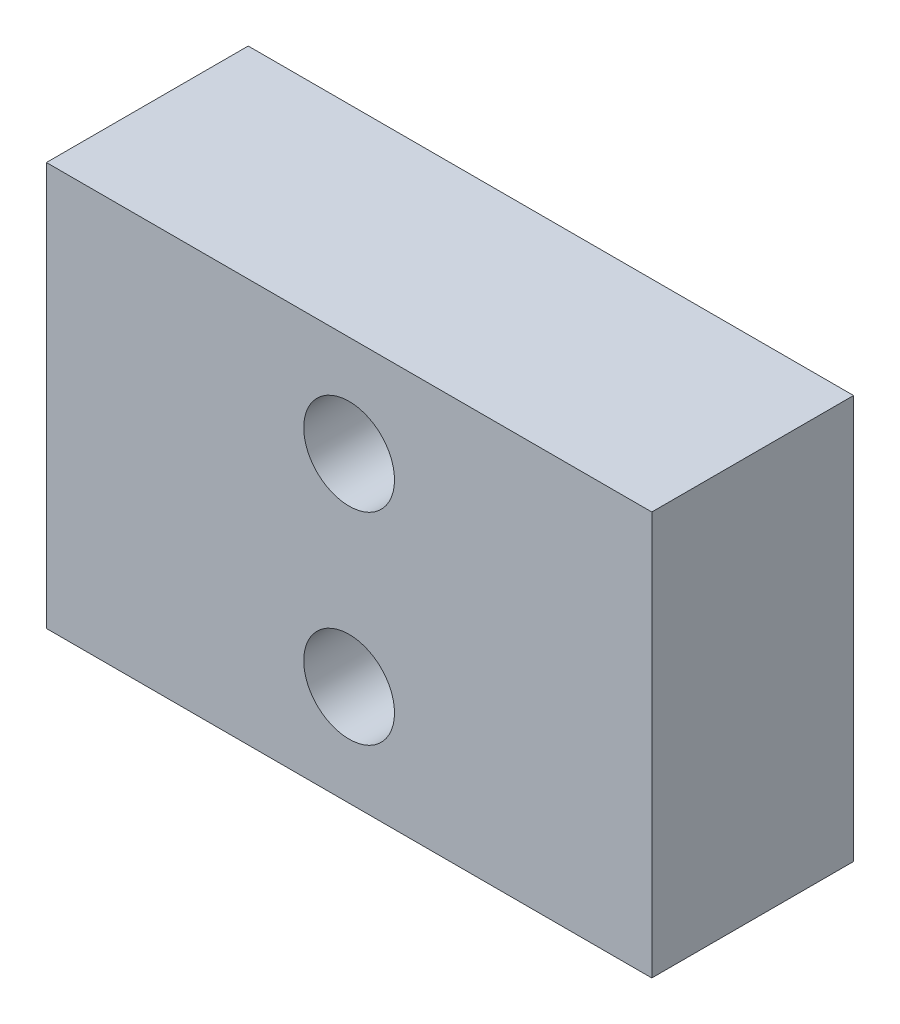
ISO-10303-21;
HEADER;
FILE_DESCRIPTION(('STEP AP214'),'2;1');
FILE_NAME('part.step','',(''),(''),'','','');
FILE_SCHEMA(('AUTOMOTIVE_DESIGN { 1 0 10303 214 1 1 1 1 }'));
ENDSEC;
DATA;
#1=APPLICATION_CONTEXT('core data for automotive mechanical design processes');
#2=APPLICATION_PROTOCOL_DEFINITION('international standard','automotive_design',2000,#1);
#3=PRODUCT_CONTEXT('',#1,'mechanical');
#4=PRODUCT('Part','Part','',(#3));
#5=PRODUCT_RELATED_PRODUCT_CATEGORY('part','',(#4));
#6=PRODUCT_DEFINITION_FORMATION('','',#4);
#7=PRODUCT_DEFINITION_CONTEXT('part definition',#1,'design');
#8=PRODUCT_DEFINITION('design','',#6,#7);
#9=PRODUCT_DEFINITION_SHAPE('','',#8);
#10=(LENGTH_UNIT() NAMED_UNIT(*) SI_UNIT(.MILLI.,.METRE.));
#11=(NAMED_UNIT(*) PLANE_ANGLE_UNIT() SI_UNIT($,.RADIAN.));
#12=(NAMED_UNIT(*) SI_UNIT($,.STERADIAN.) SOLID_ANGLE_UNIT());
#13=UNCERTAINTY_MEASURE_WITH_UNIT(LENGTH_MEASURE(1.E-05),#10,'distance_accuracy_value','');
#14=(GEOMETRIC_REPRESENTATION_CONTEXT(3) GLOBAL_UNCERTAINTY_ASSIGNED_CONTEXT((#13)) GLOBAL_UNIT_ASSIGNED_CONTEXT((#10,
#11,#12)) REPRESENTATION_CONTEXT('',''));
#15=CARTESIAN_POINT('',(0.,0.,0.));
#16=DIRECTION('',(0.,0.,1.));
#17=DIRECTION('',(1.,0.,0.));
#18=AXIS2_PLACEMENT_3D('',#15,#16,#17);
#19=CARTESIAN_POINT('',(-15.,10.,10.));
#20=DIRECTION('',(1.,0.,0.));
#21=DIRECTION('',(0.,1.,0.));
#22=AXIS2_PLACEMENT_3D('',#19,#20,#21);
#23=PLANE('',#22);
#24=DIRECTION('',(0.,-1.,0.));
#25=VECTOR('',#24,1.);
#26=CARTESIAN_POINT('',(-15.,10.,0.));
#27=LINE('',#26,#25);
#28=CARTESIAN_POINT('',(-15.,10.,0.));
#29=VERTEX_POINT('',#28);
#30=CARTESIAN_POINT('',(-15.,-10.,0.));
#31=VERTEX_POINT('',#30);
#32=EDGE_CURVE('E99',#29,#31,#27,.T.);
#33=ORIENTED_EDGE('',*,*,#32,.T.);
#34=DIRECTION('',(0.,0.,-1.));
#35=VECTOR('',#34,1.);
#36=CARTESIAN_POINT('',(-15.,-10.,10.));
#37=LINE('',#36,#35);
#38=CARTESIAN_POINT('',(-15.,-10.,10.));
#39=VERTEX_POINT('',#38);
#40=EDGE_CURVE('E11',#39,#31,#37,.T.);
#41=ORIENTED_EDGE('',*,*,#40,.F.);
#42=DIRECTION('',(0.,-1.,0.));
#43=VECTOR('',#42,1.);
#44=CARTESIAN_POINT('',(-15.,10.,10.));
#45=LINE('',#44,#43);
#46=CARTESIAN_POINT('',(-15.,10.,10.));
#47=VERTEX_POINT('',#46);
#48=EDGE_CURVE('E87',#47,#39,#45,.T.);
#49=ORIENTED_EDGE('',*,*,#48,.F.);
#50=DIRECTION('',(0.,0.,-1.));
#51=VECTOR('',#50,1.);
#52=CARTESIAN_POINT('',(-15.,10.,10.));
#53=LINE('',#52,#51);
#54=EDGE_CURVE('E95',#47,#29,#53,.T.);
#55=ORIENTED_EDGE('',*,*,#54,.T.);
#56=EDGE_LOOP('',(#33,#41,#49,#55));
#57=FACE_BOUND('',#56,.T.);
#58=ADVANCED_FACE('F36',(#57),#23,.F.);
#59=CARTESIAN_POINT('',(15.,-9.99999999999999,10.));
#60=DIRECTION('',(0.,1.,0.));
#61=DIRECTION('',(-1.,0.,0.));
#62=AXIS2_PLACEMENT_3D('',#59,#60,#61);
#63=PLANE('',#62);
#64=DIRECTION('',(1.,0.,0.));
#65=VECTOR('',#64,1.);
#66=CARTESIAN_POINT('',(15.,-9.99999999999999,0.));
#67=LINE('',#66,#65);
#68=CARTESIAN_POINT('',(15.,-9.99999999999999,0.));
#69=VERTEX_POINT('',#68);
#70=EDGE_CURVE('E91',#31,#69,#67,.T.);
#71=ORIENTED_EDGE('',*,*,#70,.T.);
#72=DIRECTION('',(0.,0.,-1.));
#73=VECTOR('',#72,1.);
#74=CARTESIAN_POINT('',(15.,-9.99999999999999,10.));
#75=LINE('',#74,#73);
#76=CARTESIAN_POINT('',(15.,-9.99999999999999,10.));
#77=VERTEX_POINT('',#76);
#78=EDGE_CURVE('E44',#77,#69,#75,.T.);
#79=ORIENTED_EDGE('',*,*,#78,.F.);
#80=DIRECTION('',(1.,0.,0.));
#81=VECTOR('',#80,1.);
#82=CARTESIAN_POINT('',(15.,-9.99999999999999,10.));
#83=LINE('',#82,#81);
#84=EDGE_CURVE('E82',#39,#77,#83,.T.);
#85=ORIENTED_EDGE('',*,*,#84,.F.);
#86=ORIENTED_EDGE('',*,*,#40,.T.);
#87=EDGE_LOOP('',(#71,#79,#85,#86));
#88=FACE_BOUND('',#87,.T.);
#89=ADVANCED_FACE('F90',(#88),#63,.F.);
#90=CARTESIAN_POINT('',(15.,10.,10.));
#91=DIRECTION('',(-1.,0.,0.));
#92=DIRECTION('',(0.,-1.,0.));
#93=AXIS2_PLACEMENT_3D('',#90,#91,#92);
#94=PLANE('',#93);
#95=DIRECTION('',(0.,1.,0.));
#96=VECTOR('',#95,1.);
#97=CARTESIAN_POINT('',(15.,10.,0.));
#98=LINE('',#97,#96);
#99=CARTESIAN_POINT('',(15.,10.,0.));
#100=VERTEX_POINT('',#99);
#101=EDGE_CURVE('E69',#69,#100,#98,.T.);
#102=ORIENTED_EDGE('',*,*,#101,.T.);
#103=DIRECTION('',(0.,0.,-1.));
#104=VECTOR('',#103,1.);
#105=CARTESIAN_POINT('',(15.,10.,10.));
#106=LINE('',#105,#104);
#107=CARTESIAN_POINT('',(15.,10.,10.));
#108=VERTEX_POINT('',#107);
#109=EDGE_CURVE('E92',#108,#100,#106,.T.);
#110=ORIENTED_EDGE('',*,*,#109,.F.);
#111=DIRECTION('',(0.,1.,0.));
#112=VECTOR('',#111,1.);
#113=CARTESIAN_POINT('',(15.,10.,10.));
#114=LINE('',#113,#112);
#115=EDGE_CURVE('E85',#77,#108,#114,.T.);
#116=ORIENTED_EDGE('',*,*,#115,.F.);
#117=ORIENTED_EDGE('',*,*,#78,.T.);
#118=EDGE_LOOP('',(#102,#110,#116,#117));
#119=FACE_BOUND('',#118,.T.);
#120=ADVANCED_FACE('F93',(#119),#94,.F.);
#121=CARTESIAN_POINT('',(15.,10.,10.));
#122=DIRECTION('',(0.,-1.,0.));
#123=DIRECTION('',(1.,0.,0.));
#124=AXIS2_PLACEMENT_3D('',#121,#122,#123);
#125=PLANE('',#124);
#126=DIRECTION('',(-1.,0.,0.));
#127=VECTOR('',#126,1.);
#128=CARTESIAN_POINT('',(15.,10.,0.));
#129=LINE('',#128,#127);
#130=EDGE_CURVE('E75',#100,#29,#129,.T.);
#131=ORIENTED_EDGE('',*,*,#130,.T.);
#132=ORIENTED_EDGE('',*,*,#54,.F.);
#133=DIRECTION('',(-1.,0.,0.));
#134=VECTOR('',#133,1.);
#135=CARTESIAN_POINT('',(15.,10.,10.));
#136=LINE('',#135,#134);
#137=EDGE_CURVE('E52',#108,#47,#136,.T.);
#138=ORIENTED_EDGE('',*,*,#137,.F.);
#139=ORIENTED_EDGE('',*,*,#109,.T.);
#140=EDGE_LOOP('',(#131,#132,#138,#139));
#141=FACE_BOUND('',#140,.T.);
#142=ADVANCED_FACE('F107',(#141),#125,.F.);
#143=CARTESIAN_POINT('',(0.,0.,10.));
#144=DIRECTION('',(0.,0.,-1.));
#145=DIRECTION('',(-1.,0.,0.));
#146=AXIS2_PLACEMENT_3D('',#143,#144,#145);
#147=PLANE('',#146);
#148=CARTESIAN_POINT('',(0.,-5.,10.));
#149=DIRECTION('',(0.,0.,1.));
#150=DIRECTION('',(1.,0.,0.));
#151=AXIS2_PLACEMENT_3D('',#148,#149,#150);
#152=CIRCLE('',#151,2.24999999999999);
#153=CARTESIAN_POINT('',(2.24999999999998,-5.,10.));
#154=VERTEX_POINT('',#153);
#155=EDGE_CURVE('E121',#154,#154,#152,.T.);
#156=ORIENTED_EDGE('',*,*,#155,.F.);
#157=EDGE_LOOP('',(#156));
#158=FACE_BOUND('',#157,.T.);
#159=CARTESIAN_POINT('',(0.,5.00000000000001,10.));
#160=DIRECTION('',(0.,0.,1.));
#161=DIRECTION('',(1.,0.,0.));
#162=AXIS2_PLACEMENT_3D('',#159,#160,#161);
#163=CIRCLE('',#162,2.24999999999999);
#164=CARTESIAN_POINT('',(2.24999999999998,5.00000000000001,10.));
#165=VERTEX_POINT('',#164);
#166=EDGE_CURVE('E115',#165,#165,#163,.T.);
#167=ORIENTED_EDGE('',*,*,#166,.F.);
#168=EDGE_LOOP('',(#167));
#169=FACE_BOUND('',#168,.T.);
#170=ORIENTED_EDGE('',*,*,#48,.T.);
#171=ORIENTED_EDGE('',*,*,#84,.T.);
#172=ORIENTED_EDGE('',*,*,#115,.T.);
#173=ORIENTED_EDGE('',*,*,#137,.T.);
#174=EDGE_LOOP('',(#170,#171,#172,#173));
#175=FACE_BOUND('',#174,.T.);
#176=ADVANCED_FACE('F83',(#158,#169,#175),#147,.F.);
#177=CARTESIAN_POINT('',(0.,0.,0.));
#178=DIRECTION('',(0.,0.,-1.));
#179=DIRECTION('',(-1.,0.,0.));
#180=AXIS2_PLACEMENT_3D('',#177,#178,#179);
#181=PLANE('',#180);
#182=CARTESIAN_POINT('',(0.,-5.,0.));
#183=DIRECTION('',(0.,0.,1.));
#184=DIRECTION('',(1.,0.,0.));
#185=AXIS2_PLACEMENT_3D('',#182,#183,#184);
#186=CIRCLE('',#185,2.25);
#187=CARTESIAN_POINT('',(2.24999999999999,-5.,0.));
#188=VERTEX_POINT('',#187);
#189=EDGE_CURVE('E118',#188,#188,#186,.T.);
#190=ORIENTED_EDGE('',*,*,#189,.T.);
#191=EDGE_LOOP('',(#190));
#192=FACE_BOUND('',#191,.T.);
#193=CARTESIAN_POINT('',(0.,5.00000000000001,0.));
#194=DIRECTION('',(0.,0.,1.));
#195=DIRECTION('',(1.,0.,0.));
#196=AXIS2_PLACEMENT_3D('',#193,#194,#195);
#197=CIRCLE('',#196,2.25);
#198=CARTESIAN_POINT('',(2.24999999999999,5.00000000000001,0.));
#199=VERTEX_POINT('',#198);
#200=EDGE_CURVE('E102',#199,#199,#197,.T.);
#201=ORIENTED_EDGE('',*,*,#200,.T.);
#202=EDGE_LOOP('',(#201));
#203=FACE_BOUND('',#202,.T.);
#204=ORIENTED_EDGE('',*,*,#32,.F.);
#205=ORIENTED_EDGE('',*,*,#130,.F.);
#206=ORIENTED_EDGE('',*,*,#101,.F.);
#207=ORIENTED_EDGE('',*,*,#70,.F.);
#208=EDGE_LOOP('',(#204,#205,#206,#207));
#209=FACE_BOUND('',#208,.T.);
#210=ADVANCED_FACE('F110',(#192,#203,#209),#181,.T.);
#211=CARTESIAN_POINT('',(0.,5.00000000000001,10.));
#212=DIRECTION('',(0.,0.,1.));
#213=DIRECTION('',(1.,0.,0.));
#214=AXIS2_PLACEMENT_3D('',#211,#212,#213);
#215=CYLINDRICAL_SURFACE('',#214,2.24999999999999);
#216=ORIENTED_EDGE('',*,*,#200,.F.);
#217=EDGE_LOOP('',(#216));
#218=FACE_BOUND('',#217,.T.);
#219=ORIENTED_EDGE('',*,*,#166,.T.);
#220=EDGE_LOOP('',(#219));
#221=FACE_BOUND('',#220,.T.);
#222=ADVANCED_FACE('F132',(#218,#221),#215,.F.);
#223=CARTESIAN_POINT('',(0.,-5.,10.));
#224=DIRECTION('',(0.,0.,1.));
#225=DIRECTION('',(1.,0.,0.));
#226=AXIS2_PLACEMENT_3D('',#223,#224,#225);
#227=CYLINDRICAL_SURFACE('',#226,2.24999999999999);
#228=ORIENTED_EDGE('',*,*,#189,.F.);
#229=EDGE_LOOP('',(#228));
#230=FACE_BOUND('',#229,.T.);
#231=ORIENTED_EDGE('',*,*,#155,.T.);
#232=EDGE_LOOP('',(#231));
#233=FACE_BOUND('',#232,.T.);
#234=ADVANCED_FACE('F125',(#230,#233),#227,.F.);
#235=CLOSED_SHELL('',(#58,#89,#120,#142,#176,#210,#222,#234));
#236=MANIFOLD_SOLID_BREP('B2',#235);
#237=ADVANCED_BREP_SHAPE_REPRESENTATION('',(#18,#236),#14);
#238=SHAPE_DEFINITION_REPRESENTATION(#9,#237);
ENDSEC;
END-ISO-10303-21;
